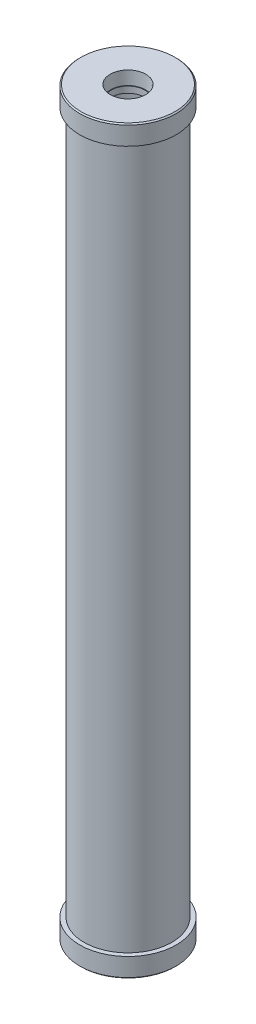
ISO-10303-21;
HEADER;
FILE_DESCRIPTION(('STEP AP214'),'2;1');
FILE_NAME('part.step','',(''),(''),'','','');
FILE_SCHEMA(('AUTOMOTIVE_DESIGN { 1 0 10303 214 1 1 1 1 }'));
ENDSEC;
DATA;
#1=APPLICATION_CONTEXT('core data for automotive mechanical design processes');
#2=APPLICATION_PROTOCOL_DEFINITION('international standard','automotive_design',2000,#1);
#3=PRODUCT_CONTEXT('',#1,'mechanical');
#4=PRODUCT('Part','Part','',(#3));
#5=PRODUCT_RELATED_PRODUCT_CATEGORY('part','',(#4));
#6=PRODUCT_DEFINITION_FORMATION('','',#4);
#7=PRODUCT_DEFINITION_CONTEXT('part definition',#1,'design');
#8=PRODUCT_DEFINITION('design','',#6,#7);
#9=PRODUCT_DEFINITION_SHAPE('','',#8);
#10=(LENGTH_UNIT() NAMED_UNIT(*) SI_UNIT(.MILLI.,.METRE.));
#11=(NAMED_UNIT(*) PLANE_ANGLE_UNIT() SI_UNIT($,.RADIAN.));
#12=(NAMED_UNIT(*) SI_UNIT($,.STERADIAN.) SOLID_ANGLE_UNIT());
#13=UNCERTAINTY_MEASURE_WITH_UNIT(LENGTH_MEASURE(1.E-05),#10,'distance_accuracy_value','');
#14=(GEOMETRIC_REPRESENTATION_CONTEXT(3) GLOBAL_UNCERTAINTY_ASSIGNED_CONTEXT((#13)) GLOBAL_UNIT_ASSIGNED_CONTEXT((#10,
#11,#12)) REPRESENTATION_CONTEXT('',''));
#15=CARTESIAN_POINT('',(0.,0.,0.));
#16=DIRECTION('',(0.,0.,1.));
#17=DIRECTION('',(1.,0.,0.));
#18=AXIS2_PLACEMENT_3D('',#15,#16,#17);
#19=CARTESIAN_POINT('',(0.,965.2,0.));
#20=DIRECTION('',(0.,-1.,0.));
#21=DIRECTION('',(0.,0.,-1.));
#22=AXIS2_PLACEMENT_3D('',#19,#20,#21);
#23=CYLINDRICAL_SURFACE('',#22,57.15);
#24=CARTESIAN_POINT('',(0.,25.4,0.));
#25=DIRECTION('',(0.,1.,0.));
#26=DIRECTION('',(0.,0.,1.));
#27=AXIS2_PLACEMENT_3D('',#24,#25,#26);
#28=CIRCLE('',#27,57.15);
#29=CARTESIAN_POINT('',(0.,25.3999999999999,-57.15));
#30=VERTEX_POINT('',#29);
#31=EDGE_CURVE('E71',#30,#30,#28,.T.);
#32=CARTESIAN_POINT('',(0.,939.8,0.));
#33=DIRECTION('',(0.,1.,0.));
#34=DIRECTION('',(0.,0.,1.));
#35=AXIS2_PLACEMENT_3D('',#32,#33,#34);
#36=CIRCLE('',#35,57.15);
#37=CARTESIAN_POINT('',(0.,939.8,-57.15));
#38=VERTEX_POINT('',#37);
#39=EDGE_CURVE('E53',#38,#38,#36,.T.);
#40=CARTESIAN_POINT('',(0.,25.3999999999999,-57.15));
#41=CARTESIAN_POINT('',(0.,34.9249999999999,-57.15));
#42=CARTESIAN_POINT('',(0.,44.4499999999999,-57.15));
#43=CARTESIAN_POINT('',(0.,63.4999999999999,-57.15));
#44=CARTESIAN_POINT('',(0.,73.0249999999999,-57.15));
#45=CARTESIAN_POINT('',(0.,92.0749999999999,-57.15));
#46=CARTESIAN_POINT('',(0.,101.6,-57.15));
#47=CARTESIAN_POINT('',(0.,120.65,-57.15));
#48=CARTESIAN_POINT('',(0.,130.175,-57.15));
#49=CARTESIAN_POINT('',(0.,149.225,-57.15));
#50=CARTESIAN_POINT('',(0.,158.75,-57.15));
#51=CARTESIAN_POINT('',(0.,177.8,-57.15));
#52=CARTESIAN_POINT('',(0.,187.325,-57.15));
#53=CARTESIAN_POINT('',(0.,206.375,-57.15));
#54=CARTESIAN_POINT('',(0.,215.9,-57.15));
#55=CARTESIAN_POINT('',(0.,234.95,-57.15));
#56=CARTESIAN_POINT('',(0.,244.475,-57.15));
#57=CARTESIAN_POINT('',(0.,263.525,-57.15));
#58=CARTESIAN_POINT('',(0.,273.05,-57.15));
#59=CARTESIAN_POINT('',(0.,292.1,-57.15));
#60=CARTESIAN_POINT('',(0.,301.625,-57.15));
#61=CARTESIAN_POINT('',(0.,320.675,-57.15));
#62=CARTESIAN_POINT('',(0.,330.2,-57.15));
#63=CARTESIAN_POINT('',(0.,349.25,-57.15));
#64=CARTESIAN_POINT('',(0.,358.775,-57.15));
#65=CARTESIAN_POINT('',(0.,377.825,-57.15));
#66=CARTESIAN_POINT('',(0.,387.35,-57.15));
#67=CARTESIAN_POINT('',(0.,406.4,-57.15));
#68=CARTESIAN_POINT('',(0.,415.925,-57.15));
#69=CARTESIAN_POINT('',(0.,434.975,-57.15));
#70=CARTESIAN_POINT('',(0.,444.5,-57.15));
#71=CARTESIAN_POINT('',(0.,463.55,-57.15));
#72=CARTESIAN_POINT('',(0.,473.075,-57.15));
#73=CARTESIAN_POINT('',(0.,492.125,-57.15));
#74=CARTESIAN_POINT('',(0.,501.65,-57.15));
#75=CARTESIAN_POINT('',(0.,520.7,-57.15));
#76=CARTESIAN_POINT('',(0.,530.225,-57.15));
#77=CARTESIAN_POINT('',(0.,549.275,-57.15));
#78=CARTESIAN_POINT('',(0.,558.8,-57.15));
#79=CARTESIAN_POINT('',(0.,577.85,-57.15));
#80=CARTESIAN_POINT('',(0.,587.375,-57.15));
#81=CARTESIAN_POINT('',(0.,606.425,-57.15));
#82=CARTESIAN_POINT('',(0.,615.95,-57.15));
#83=CARTESIAN_POINT('',(0.,635.,-57.15));
#84=CARTESIAN_POINT('',(0.,644.525,-57.15));
#85=CARTESIAN_POINT('',(0.,663.575,-57.15));
#86=CARTESIAN_POINT('',(0.,673.1,-57.15));
#87=CARTESIAN_POINT('',(0.,692.15,-57.15));
#88=CARTESIAN_POINT('',(0.,701.675,-57.15));
#89=CARTESIAN_POINT('',(0.,720.725,-57.15));
#90=CARTESIAN_POINT('',(0.,730.25,-57.15));
#91=CARTESIAN_POINT('',(0.,749.3,-57.15));
#92=CARTESIAN_POINT('',(0.,758.825,-57.15));
#93=CARTESIAN_POINT('',(0.,777.875,-57.15));
#94=CARTESIAN_POINT('',(0.,787.4,-57.15));
#95=CARTESIAN_POINT('',(0.,806.45,-57.15));
#96=CARTESIAN_POINT('',(0.,815.975,-57.15));
#97=CARTESIAN_POINT('',(0.,835.025,-57.15));
#98=CARTESIAN_POINT('',(0.,844.55,-57.15));
#99=CARTESIAN_POINT('',(0.,863.6,-57.15));
#100=CARTESIAN_POINT('',(0.,873.125,-57.15));
#101=CARTESIAN_POINT('',(0.,892.175,-57.15));
#102=CARTESIAN_POINT('',(0.,901.7,-57.15));
#103=CARTESIAN_POINT('',(0.,920.75,-57.15));
#104=CARTESIAN_POINT('',(0.,930.275,-57.15));
#105=CARTESIAN_POINT('',(0.,939.8,-57.15));
#106=B_SPLINE_CURVE_WITH_KNOTS('',3,(#40,#41,#42,#43,#44,#45,#46,#47,#48,#49,#50,#51,#52,#53,
#54,#55,#56,#57,#58,#59,#60,#61,#62,#63,#64,#65,#66,#67,#68,#69,#70,#71,#72,#73,#74,#75,#76,#77,
#78,#79,#80,#81,#82,#83,#84,#85,#86,#87,#88,#89,#90,#91,#92,#93,#94,#95,#96,#97,#98,#99,#100,
#101,#102,#103,#104,#105),.UNSPECIFIED.,.F.,.F.,(4,2,2,2,2,2,2,2,2,2,2,2,2,2,2,2,2,2,2,2,2,2,2,
2,2,2,2,2,2,2,2,2,4),(0.,28.575,57.15,85.7250000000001,114.3,142.875,171.45,200.025,228.6,
257.175,285.75,314.325,342.9,371.475,400.05,428.625,457.2,485.775,514.35,542.925,571.5,600.075,
628.65,657.225,685.8,714.375,742.95,771.525,800.1,828.675,857.25,885.825,914.4),.UNSPECIFIED.);
#107=EDGE_CURVE('BSEAM33',#30,#38,#106,.T.);
#108=ORIENTED_EDGE('',*,*,#31,.T.);
#109=ORIENTED_EDGE('',*,*,#39,.F.);
#110=ORIENTED_EDGE('',*,*,#107,.T.);
#111=ORIENTED_EDGE('',*,*,#107,.F.);
#112=EDGE_LOOP('',(#108,#110,#109,#111));
#113=FACE_BOUND('',#112,.T.);
#114=ADVANCED_FACE('F33',(#113),#23,.T.);
#115=CARTESIAN_POINT('',(0.,965.2,0.));
#116=DIRECTION('',(0.,-1.,0.));
#117=DIRECTION('',(0.,0.,-1.));
#118=AXIS2_PLACEMENT_3D('',#115,#116,#117);
#119=CYLINDRICAL_SURFACE('',#118,50.546);
#120=CARTESIAN_POINT('',(0.,25.4,0.));
#121=DIRECTION('',(0.,1.,0.));
#122=DIRECTION('',(0.,0.,1.));
#123=AXIS2_PLACEMENT_3D('',#120,#121,#122);
#124=CIRCLE('',#123,50.546);
#125=CARTESIAN_POINT('',(0.,25.3999999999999,-50.546));
#126=VERTEX_POINT('',#125);
#127=EDGE_CURVE('E68',#126,#126,#124,.T.);
#128=CARTESIAN_POINT('',(0.,939.8,0.));
#129=DIRECTION('',(0.,1.,0.));
#130=DIRECTION('',(0.,0.,1.));
#131=AXIS2_PLACEMENT_3D('',#128,#129,#130);
#132=CIRCLE('',#131,50.546);
#133=CARTESIAN_POINT('',(0.,939.8,-50.546));
#134=VERTEX_POINT('',#133);
#135=EDGE_CURVE('E59',#134,#134,#132,.T.);
#136=CARTESIAN_POINT('',(0.,25.3999999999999,-50.546));
#137=CARTESIAN_POINT('',(0.,34.9249999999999,-50.546));
#138=CARTESIAN_POINT('',(0.,44.4499999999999,-50.546));
#139=CARTESIAN_POINT('',(0.,63.4999999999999,-50.546));
#140=CARTESIAN_POINT('',(0.,73.0249999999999,-50.546));
#141=CARTESIAN_POINT('',(0.,92.0749999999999,-50.546));
#142=CARTESIAN_POINT('',(0.,101.6,-50.546));
#143=CARTESIAN_POINT('',(0.,120.65,-50.546));
#144=CARTESIAN_POINT('',(0.,130.175,-50.546));
#145=CARTESIAN_POINT('',(0.,149.225,-50.546));
#146=CARTESIAN_POINT('',(0.,158.75,-50.546));
#147=CARTESIAN_POINT('',(0.,177.8,-50.546));
#148=CARTESIAN_POINT('',(0.,187.325,-50.546));
#149=CARTESIAN_POINT('',(0.,206.375,-50.546));
#150=CARTESIAN_POINT('',(0.,215.9,-50.546));
#151=CARTESIAN_POINT('',(0.,234.95,-50.546));
#152=CARTESIAN_POINT('',(0.,244.475,-50.546));
#153=CARTESIAN_POINT('',(0.,263.525,-50.546));
#154=CARTESIAN_POINT('',(0.,273.05,-50.546));
#155=CARTESIAN_POINT('',(0.,292.1,-50.546));
#156=CARTESIAN_POINT('',(0.,301.625,-50.546));
#157=CARTESIAN_POINT('',(0.,320.675,-50.546));
#158=CARTESIAN_POINT('',(0.,330.2,-50.546));
#159=CARTESIAN_POINT('',(0.,349.25,-50.546));
#160=CARTESIAN_POINT('',(0.,358.775,-50.546));
#161=CARTESIAN_POINT('',(0.,377.825,-50.546));
#162=CARTESIAN_POINT('',(0.,387.35,-50.546));
#163=CARTESIAN_POINT('',(0.,406.4,-50.546));
#164=CARTESIAN_POINT('',(0.,415.925,-50.546));
#165=CARTESIAN_POINT('',(0.,434.975,-50.546));
#166=CARTESIAN_POINT('',(0.,444.5,-50.546));
#167=CARTESIAN_POINT('',(0.,463.55,-50.546));
#168=CARTESIAN_POINT('',(0.,473.075,-50.546));
#169=CARTESIAN_POINT('',(0.,492.125,-50.546));
#170=CARTESIAN_POINT('',(0.,501.65,-50.546));
#171=CARTESIAN_POINT('',(0.,520.7,-50.546));
#172=CARTESIAN_POINT('',(0.,530.225,-50.546));
#173=CARTESIAN_POINT('',(0.,549.275,-50.546));
#174=CARTESIAN_POINT('',(0.,558.8,-50.546));
#175=CARTESIAN_POINT('',(0.,577.85,-50.546));
#176=CARTESIAN_POINT('',(0.,587.375,-50.546));
#177=CARTESIAN_POINT('',(0.,606.425,-50.546));
#178=CARTESIAN_POINT('',(0.,615.95,-50.546));
#179=CARTESIAN_POINT('',(0.,635.,-50.546));
#180=CARTESIAN_POINT('',(0.,644.525,-50.546));
#181=CARTESIAN_POINT('',(0.,663.575,-50.546));
#182=CARTESIAN_POINT('',(0.,673.1,-50.546));
#183=CARTESIAN_POINT('',(0.,692.15,-50.546));
#184=CARTESIAN_POINT('',(0.,701.675,-50.546));
#185=CARTESIAN_POINT('',(0.,720.725,-50.546));
#186=CARTESIAN_POINT('',(0.,730.25,-50.546));
#187=CARTESIAN_POINT('',(0.,749.3,-50.546));
#188=CARTESIAN_POINT('',(0.,758.825,-50.546));
#189=CARTESIAN_POINT('',(0.,777.875,-50.546));
#190=CARTESIAN_POINT('',(0.,787.4,-50.546));
#191=CARTESIAN_POINT('',(0.,806.45,-50.546));
#192=CARTESIAN_POINT('',(0.,815.975,-50.546));
#193=CARTESIAN_POINT('',(0.,835.025,-50.546));
#194=CARTESIAN_POINT('',(0.,844.55,-50.546));
#195=CARTESIAN_POINT('',(0.,863.6,-50.546));
#196=CARTESIAN_POINT('',(0.,873.125,-50.546));
#197=CARTESIAN_POINT('',(0.,892.175,-50.546));
#198=CARTESIAN_POINT('',(0.,901.7,-50.546));
#199=CARTESIAN_POINT('',(0.,920.75,-50.546));
#200=CARTESIAN_POINT('',(0.,930.275,-50.546));
#201=CARTESIAN_POINT('',(0.,939.8,-50.546));
#202=B_SPLINE_CURVE_WITH_KNOTS('',3,(#136,#137,#138,#139,#140,#141,#142,#143,#144,#145,#146,
#147,#148,#149,#150,#151,#152,#153,#154,#155,#156,#157,#158,#159,#160,#161,#162,#163,#164,#165,
#166,#167,#168,#169,#170,#171,#172,#173,#174,#175,#176,#177,#178,#179,#180,#181,#182,#183,#184,
#185,#186,#187,#188,#189,#190,#191,#192,#193,#194,#195,#196,#197,#198,#199,#200,#201),
.UNSPECIFIED.,.F.,.F.,(4,2,2,2,2,2,2,2,2,2,2,2,2,2,2,2,2,2,2,2,2,2,2,2,2,2,2,2,2,2,2,2,4),(0.,
28.575,57.15,85.7250000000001,114.3,142.875,171.45,200.025,228.6,257.175,285.75,314.325,342.9,
371.475,400.05,428.625,457.2,485.775,514.35,542.925,571.5,600.075,628.65,657.225,685.8,714.375,
742.95,771.525,800.1,828.675,857.25,885.825,914.4),.UNSPECIFIED.);
#203=EDGE_CURVE('BSEAM115',#126,#134,#202,.T.);
#204=ORIENTED_EDGE('',*,*,#127,.F.);
#205=ORIENTED_EDGE('',*,*,#135,.T.);
#206=ORIENTED_EDGE('',*,*,#203,.T.);
#207=ORIENTED_EDGE('',*,*,#203,.F.);
#208=EDGE_LOOP('',(#204,#206,#205,#207));
#209=FACE_BOUND('',#208,.T.);
#210=ADVANCED_FACE('F115',(#209),#119,.F.);
#211=CARTESIAN_POINT('',(0.,25.4,0.));
#212=DIRECTION('',(0.,1.,0.));
#213=DIRECTION('',(0.,0.,1.));
#214=AXIS2_PLACEMENT_3D('',#211,#212,#213);
#215=PLANE('',#214);
#216=CARTESIAN_POINT('',(0.,25.4,0.));
#217=DIRECTION('',(0.,1.,0.));
#218=DIRECTION('',(0.,0.,1.));
#219=AXIS2_PLACEMENT_3D('',#216,#217,#218);
#220=CIRCLE('',#219,21.8313);
#221=CARTESIAN_POINT('',(0.,25.4,21.8313));
#222=VERTEX_POINT('',#221);
#223=EDGE_CURVE('E63',#222,#222,#220,.T.);
#224=ORIENTED_EDGE('',*,*,#223,.F.);
#225=EDGE_LOOP('',(#224));
#226=FACE_BOUND('',#225,.T.);
#227=ORIENTED_EDGE('',*,*,#127,.T.);
#228=EDGE_LOOP('',(#227));
#229=FACE_BOUND('',#228,.T.);
#230=ADVANCED_FACE('F121',(#226,#229),#215,.T.);
#231=CARTESIAN_POINT('',(0.,25.4,0.));
#232=DIRECTION('',(0.,1.,0.));
#233=DIRECTION('',(0.,0.,1.));
#234=AXIS2_PLACEMENT_3D('',#231,#232,#233);
#235=CIRCLE('',#234,62.865);
#236=CARTESIAN_POINT('',(0.,25.4,62.865));
#237=VERTEX_POINT('',#236);
#238=EDGE_CURVE('E66',#237,#237,#235,.T.);
#239=ORIENTED_EDGE('',*,*,#238,.T.);
#240=EDGE_LOOP('',(#239));
#241=FACE_BOUND('',#240,.T.);
#242=ORIENTED_EDGE('',*,*,#31,.F.);
#243=EDGE_LOOP('',(#242));
#244=FACE_BOUND('',#243,.T.);
#245=ADVANCED_FACE('F142',(#241,#244),#215,.T.);
#246=CARTESIAN_POINT('',(0.,25.4,0.));
#247=DIRECTION('',(0.,-1.,0.));
#248=DIRECTION('',(0.,0.,-1.));
#249=AXIS2_PLACEMENT_3D('',#246,#247,#248);
#250=CYLINDRICAL_SURFACE('',#249,62.865);
#251=CARTESIAN_POINT('',(0.,1.52400000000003,0.));
#252=DIRECTION('',(0.,1.,0.));
#253=DIRECTION('',(0.,0.,1.));
#254=AXIS2_PLACEMENT_3D('',#251,#252,#253);
#255=CIRCLE('',#254,62.865);
#256=CARTESIAN_POINT('',(0.,1.52400000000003,62.865));
#257=VERTEX_POINT('',#256);
#258=EDGE_CURVE('E48',#257,#257,#255,.T.);
#259=ORIENTED_EDGE('',*,*,#258,.T.);
#260=EDGE_LOOP('',(#259));
#261=FACE_BOUND('',#260,.T.);
#262=ORIENTED_EDGE('',*,*,#238,.F.);
#263=EDGE_LOOP('',(#262));
#264=FACE_BOUND('',#263,.T.);
#265=ADVANCED_FACE('F139',(#261,#264),#250,.T.);
#266=CARTESIAN_POINT('',(0.,0.,0.));
#267=DIRECTION('',(0.,1.,0.));
#268=DIRECTION('',(0.,0.,1.));
#269=AXIS2_PLACEMENT_3D('',#266,#267,#268);
#270=PLANE('',#269);
#271=CARTESIAN_POINT('',(0.,0.,0.));
#272=DIRECTION('',(0.,1.,0.));
#273=DIRECTION('',(0.,0.,1.));
#274=AXIS2_PLACEMENT_3D('',#271,#272,#273);
#275=CIRCLE('',#274,61.341);
#276=CARTESIAN_POINT('',(0.,0.,61.341));
#277=VERTEX_POINT('',#276);
#278=EDGE_CURVE('E44',#277,#277,#275,.F.);
#279=ORIENTED_EDGE('',*,*,#278,.T.);
#280=EDGE_LOOP('',(#279));
#281=FACE_BOUND('',#280,.T.);
#282=CARTESIAN_POINT('',(0.,0.,0.));
#283=DIRECTION('',(0.,-1.,0.));
#284=DIRECTION('',(0.,0.,-1.));
#285=AXIS2_PLACEMENT_3D('',#282,#283,#284);
#286=CIRCLE('',#285,23.1430322);
#287=CARTESIAN_POINT('',(0.,0.,-23.1430322));
#288=VERTEX_POINT('',#287);
#289=EDGE_CURVE('E62',#288,#288,#286,.T.);
#290=ORIENTED_EDGE('',*,*,#289,.F.);
#291=EDGE_LOOP('',(#290));
#292=FACE_BOUND('',#291,.T.);
#293=ADVANCED_FACE('F124',(#281,#292),#270,.F.);
#294=CARTESIAN_POINT('',(0.,0.,0.));
#295=DIRECTION('',(0.,-1.,0.));
#296=DIRECTION('',(0.,0.,-1.));
#297=AXIS2_PLACEMENT_3D('',#294,#295,#296);
#298=CYLINDRICAL_SURFACE('',#297,21.8313);
#299=ORIENTED_EDGE('',*,*,#223,.T.);
#300=EDGE_LOOP('',(#299));
#301=FACE_BOUND('',#300,.T.);
#302=CARTESIAN_POINT('',(0.,17.272,0.));
#303=DIRECTION('',(0.,-1.,0.));
#304=DIRECTION('',(0.,0.,-1.));
#305=AXIS2_PLACEMENT_3D('',#302,#303,#304);
#306=CIRCLE('',#305,21.8313);
#307=CARTESIAN_POINT('',(0.,17.272,-21.8313));
#308=VERTEX_POINT('',#307);
#309=EDGE_CURVE('E67',#308,#308,#306,.T.);
#310=ORIENTED_EDGE('',*,*,#309,.T.);
#311=EDGE_LOOP('',(#310));
#312=FACE_BOUND('',#311,.T.);
#313=ADVANCED_FACE('F155',(#301,#312),#298,.F.);
#314=CARTESIAN_POINT('',(21.8313,17.272,0.));
#315=DIRECTION('',(0.,1.,0.));
#316=DIRECTION('',(0.,0.,1.));
#317=AXIS2_PLACEMENT_3D('',#314,#315,#316);
#318=PLANE('',#317);
#319=ORIENTED_EDGE('',*,*,#309,.F.);
#320=EDGE_LOOP('',(#319));
#321=FACE_BOUND('',#320,.T.);
#322=CARTESIAN_POINT('',(0.,17.272,0.));
#323=DIRECTION('',(0.,-1.,0.));
#324=DIRECTION('',(0.,0.,-1.));
#325=AXIS2_PLACEMENT_3D('',#322,#323,#324);
#326=CIRCLE('',#325,22.6258853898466);
#327=CARTESIAN_POINT('',(0.,17.272,-22.6258853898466));
#328=VERTEX_POINT('',#327);
#329=EDGE_CURVE('E78',#328,#328,#326,.T.);
#330=ORIENTED_EDGE('',*,*,#329,.T.);
#331=EDGE_LOOP('',(#330));
#332=FACE_BOUND('',#331,.T.);
#333=ADVANCED_FACE('F158',(#321,#332),#318,.F.);
#334=CARTESIAN_POINT('',(0.,0.,0.));
#335=DIRECTION('',(0.,-1.,0.));
#336=DIRECTION('',(0.,0.,-1.));
#337=AXIS2_PLACEMENT_3D('',#334,#335,#336);
#338=CONICAL_SURFACE('',#337,23.1430322,0.0299323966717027);
#339=ORIENTED_EDGE('',*,*,#329,.F.);
#340=EDGE_LOOP('',(#339));
#341=FACE_BOUND('',#340,.T.);
#342=ORIENTED_EDGE('',*,*,#289,.T.);
#343=EDGE_LOOP('',(#342));
#344=FACE_BOUND('',#343,.T.);
#345=ADVANCED_FACE('F162',(#341,#344),#338,.F.);
#346=CARTESIAN_POINT('',(0.,939.8,0.));
#347=DIRECTION('',(0.,1.,0.));
#348=DIRECTION('',(0.,0.,1.));
#349=AXIS2_PLACEMENT_3D('',#346,#347,#348);
#350=PLANE('',#349);
#351=CARTESIAN_POINT('',(0.,939.8,0.));
#352=DIRECTION('',(0.,1.,0.));
#353=DIRECTION('',(0.,0.,1.));
#354=AXIS2_PLACEMENT_3D('',#351,#352,#353);
#355=CIRCLE('',#354,21.8313);
#356=CARTESIAN_POINT('',(0.,939.8,21.8313));
#357=VERTEX_POINT('',#356);
#358=EDGE_CURVE('E54',#357,#357,#355,.T.);
#359=ORIENTED_EDGE('',*,*,#358,.T.);
#360=EDGE_LOOP('',(#359));
#361=FACE_BOUND('',#360,.T.);
#362=ORIENTED_EDGE('',*,*,#135,.F.);
#363=EDGE_LOOP('',(#362));
#364=FACE_BOUND('',#363,.T.);
#365=ADVANCED_FACE('F165',(#361,#364),#350,.F.);
#366=CARTESIAN_POINT('',(0.,939.8,0.));
#367=DIRECTION('',(0.,1.,0.));
#368=DIRECTION('',(0.,0.,1.));
#369=AXIS2_PLACEMENT_3D('',#366,#367,#368);
#370=CIRCLE('',#369,62.865);
#371=CARTESIAN_POINT('',(0.,939.8,62.865));
#372=VERTEX_POINT('',#371);
#373=EDGE_CURVE('E57',#372,#372,#370,.T.);
#374=ORIENTED_EDGE('',*,*,#373,.F.);
#375=EDGE_LOOP('',(#374));
#376=FACE_BOUND('',#375,.T.);
#377=ORIENTED_EDGE('',*,*,#39,.T.);
#378=EDGE_LOOP('',(#377));
#379=FACE_BOUND('',#378,.T.);
#380=ADVANCED_FACE('F110',(#376,#379),#350,.F.);
#381=CARTESIAN_POINT('',(0.,939.8,0.));
#382=DIRECTION('',(0.,1.,0.));
#383=DIRECTION('',(0.,0.,1.));
#384=AXIS2_PLACEMENT_3D('',#381,#382,#383);
#385=CYLINDRICAL_SURFACE('',#384,62.865);
#386=CARTESIAN_POINT('',(0.,963.676,0.));
#387=DIRECTION('',(0.,1.,0.));
#388=DIRECTION('',(0.,0.,1.));
#389=AXIS2_PLACEMENT_3D('',#386,#387,#388);
#390=CIRCLE('',#389,62.865);
#391=CARTESIAN_POINT('',(0.,963.676,62.865));
#392=VERTEX_POINT('',#391);
#393=EDGE_CURVE('E10',#392,#392,#390,.F.);
#394=ORIENTED_EDGE('',*,*,#393,.T.);
#395=EDGE_LOOP('',(#394));
#396=FACE_BOUND('',#395,.T.);
#397=ORIENTED_EDGE('',*,*,#373,.T.);
#398=EDGE_LOOP('',(#397));
#399=FACE_BOUND('',#398,.T.);
#400=ADVANCED_FACE('F101',(#396,#399),#385,.T.);
#401=CARTESIAN_POINT('',(0.,965.2,0.));
#402=DIRECTION('',(0.,1.,0.));
#403=DIRECTION('',(0.,0.,1.));
#404=AXIS2_PLACEMENT_3D('',#401,#402,#403);
#405=PLANE('',#404);
#406=CARTESIAN_POINT('',(0.,965.2,0.));
#407=DIRECTION('',(0.,1.,0.));
#408=DIRECTION('',(0.,0.,1.));
#409=AXIS2_PLACEMENT_3D('',#406,#407,#408);
#410=CIRCLE('',#409,61.3410000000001);
#411=CARTESIAN_POINT('',(0.,965.2,61.3410000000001));
#412=VERTEX_POINT('',#411);
#413=EDGE_CURVE('E40',#412,#412,#410,.T.);
#414=ORIENTED_EDGE('',*,*,#413,.T.);
#415=EDGE_LOOP('',(#414));
#416=FACE_BOUND('',#415,.T.);
#417=CARTESIAN_POINT('',(0.,965.2,0.));
#418=DIRECTION('',(0.,1.,0.));
#419=DIRECTION('',(0.,0.,1.));
#420=AXIS2_PLACEMENT_3D('',#417,#418,#419);
#421=CIRCLE('',#420,23.1430322);
#422=CARTESIAN_POINT('',(0.,965.2,23.1430322));
#423=VERTEX_POINT('',#422);
#424=EDGE_CURVE('E92',#423,#423,#421,.T.);
#425=ORIENTED_EDGE('',*,*,#424,.F.);
#426=EDGE_LOOP('',(#425));
#427=FACE_BOUND('',#426,.T.);
#428=ADVANCED_FACE('F98',(#416,#427),#405,.T.);
#429=CARTESIAN_POINT('',(0.,965.2,0.));
#430=DIRECTION('',(0.,1.,0.));
#431=DIRECTION('',(0.,0.,1.));
#432=AXIS2_PLACEMENT_3D('',#429,#430,#431);
#433=CYLINDRICAL_SURFACE('',#432,21.8313);
#434=CARTESIAN_POINT('',(0.,947.928,0.));
#435=DIRECTION('',(0.,1.,0.));
#436=DIRECTION('',(0.,0.,1.));
#437=AXIS2_PLACEMENT_3D('',#434,#435,#436);
#438=CIRCLE('',#437,21.8313);
#439=CARTESIAN_POINT('',(0.,947.928,21.8313));
#440=VERTEX_POINT('',#439);
#441=EDGE_CURVE('E58',#440,#440,#438,.T.);
#442=ORIENTED_EDGE('',*,*,#441,.T.);
#443=EDGE_LOOP('',(#442));
#444=FACE_BOUND('',#443,.T.);
#445=ORIENTED_EDGE('',*,*,#358,.F.);
#446=EDGE_LOOP('',(#445));
#447=FACE_BOUND('',#446,.T.);
#448=ADVANCED_FACE('F100',(#444,#447),#433,.F.);
#449=CARTESIAN_POINT('',(21.8313,947.928,0.));
#450=DIRECTION('',(0.,-1.,0.));
#451=DIRECTION('',(0.,0.,-1.));
#452=AXIS2_PLACEMENT_3D('',#449,#450,#451);
#453=PLANE('',#452);
#454=ORIENTED_EDGE('',*,*,#441,.F.);
#455=EDGE_LOOP('',(#454));
#456=FACE_BOUND('',#455,.T.);
#457=CARTESIAN_POINT('',(0.,947.928,0.));
#458=DIRECTION('',(0.,1.,0.));
#459=DIRECTION('',(0.,0.,1.));
#460=AXIS2_PLACEMENT_3D('',#457,#458,#459);
#461=CIRCLE('',#460,22.6258853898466);
#462=CARTESIAN_POINT('',(0.,947.928,22.6258853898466));
#463=VERTEX_POINT('',#462);
#464=EDGE_CURVE('E89',#463,#463,#461,.T.);
#465=ORIENTED_EDGE('',*,*,#464,.T.);
#466=EDGE_LOOP('',(#465));
#467=FACE_BOUND('',#466,.T.);
#468=ADVANCED_FACE('F107',(#456,#467),#453,.F.);
#469=CARTESIAN_POINT('',(0.,965.2,0.));
#470=DIRECTION('',(0.,1.,0.));
#471=DIRECTION('',(0.,0.,1.));
#472=AXIS2_PLACEMENT_3D('',#469,#470,#471);
#473=CONICAL_SURFACE('',#472,23.1430322,0.0299323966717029);
#474=ORIENTED_EDGE('',*,*,#464,.F.);
#475=EDGE_LOOP('',(#474));
#476=FACE_BOUND('',#475,.T.);
#477=ORIENTED_EDGE('',*,*,#424,.T.);
#478=EDGE_LOOP('',(#477));
#479=FACE_BOUND('',#478,.T.);
#480=ADVANCED_FACE('F96',(#476,#479),#473,.F.);
#481=CARTESIAN_POINT('',(0.,1.52400000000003,0.));
#482=DIRECTION('',(0.,1.,0.));
#483=DIRECTION('',(0.,0.,1.));
#484=AXIS2_PLACEMENT_3D('',#481,#482,#483);
#485=CONICAL_SURFACE('',#484,62.865,0.785398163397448);
#486=CARTESIAN_POINT('',(0.,0.,61.341));
#487=CARTESIAN_POINT('',(0.,0.0158749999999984,61.356875));
#488=CARTESIAN_POINT('',(0.,0.0317499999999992,61.37275));
#489=CARTESIAN_POINT('',(0.,0.0635000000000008,61.4045));
#490=CARTESIAN_POINT('',(0.,0.0793750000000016,61.420375));
#491=CARTESIAN_POINT('',(0.,0.111125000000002,61.452125));
#492=CARTESIAN_POINT('',(0.,0.127000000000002,61.468));
#493=CARTESIAN_POINT('',(0.,0.158750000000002,61.49975));
#494=CARTESIAN_POINT('',(0.,0.174625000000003,61.515625));
#495=CARTESIAN_POINT('',(0.,0.206375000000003,61.547375));
#496=CARTESIAN_POINT('',(0.,0.222250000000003,61.56325));
#497=CARTESIAN_POINT('',(0.,0.254000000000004,61.595));
#498=CARTESIAN_POINT('',(0.,0.269875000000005,61.610875));
#499=CARTESIAN_POINT('',(0.,0.301625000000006,61.642625));
#500=CARTESIAN_POINT('',(0.,0.317500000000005,61.6585));
#501=CARTESIAN_POINT('',(0.,0.349250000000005,61.69025));
#502=CARTESIAN_POINT('',(0.,0.365125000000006,61.706125));
#503=CARTESIAN_POINT('',(0.,0.396875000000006,61.737875));
#504=CARTESIAN_POINT('',(0.,0.412750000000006,61.75375));
#505=CARTESIAN_POINT('',(0.,0.444500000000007,61.7855));
#506=CARTESIAN_POINT('',(0.,0.460375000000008,61.801375));
#507=CARTESIAN_POINT('',(0.,0.492125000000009,61.833125));
#508=CARTESIAN_POINT('',(0.,0.508000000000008,61.849));
#509=CARTESIAN_POINT('',(0.,0.539750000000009,61.88075));
#510=CARTESIAN_POINT('',(0.,0.555625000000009,61.896625));
#511=CARTESIAN_POINT('',(0.,0.587375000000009,61.928375));
#512=CARTESIAN_POINT('',(0.,0.603250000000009,61.94425));
#513=CARTESIAN_POINT('',(0.,0.63500000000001,61.976));
#514=CARTESIAN_POINT('',(0.,0.650875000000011,61.991875));
#515=CARTESIAN_POINT('',(0.,0.682625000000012,62.023625));
#516=CARTESIAN_POINT('',(0.,0.698500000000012,62.0395));
#517=CARTESIAN_POINT('',(0.,0.730250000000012,62.07125));
#518=CARTESIAN_POINT('',(0.,0.746125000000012,62.087125));
#519=CARTESIAN_POINT('',(0.,0.777875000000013,62.118875));
#520=CARTESIAN_POINT('',(0.,0.793750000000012,62.13475));
#521=CARTESIAN_POINT('',(0.,0.825500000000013,62.1665));
#522=CARTESIAN_POINT('',(0.,0.841375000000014,62.182375));
#523=CARTESIAN_POINT('',(0.,0.873125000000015,62.214125));
#524=CARTESIAN_POINT('',(0.,0.889000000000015,62.23));
#525=CARTESIAN_POINT('',(0.,0.920750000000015,62.26175));
#526=CARTESIAN_POINT('',(0.,0.936625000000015,62.277625));
#527=CARTESIAN_POINT('',(0.,0.968375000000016,62.309375));
#528=CARTESIAN_POINT('',(0.,0.984250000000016,62.32525));
#529=CARTESIAN_POINT('',(0.,1.01600000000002,62.357));
#530=CARTESIAN_POINT('',(0.,1.03187500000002,62.372875));
#531=CARTESIAN_POINT('',(0.,1.06362500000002,62.404625));
#532=CARTESIAN_POINT('',(0.,1.07950000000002,62.4205));
#533=CARTESIAN_POINT('',(0.,1.11125000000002,62.45225));
#534=CARTESIAN_POINT('',(0.,1.12712500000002,62.468125));
#535=CARTESIAN_POINT('',(0.,1.15887500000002,62.499875));
#536=CARTESIAN_POINT('',(0.,1.17475000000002,62.51575));
#537=CARTESIAN_POINT('',(0.,1.20650000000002,62.5475));
#538=CARTESIAN_POINT('',(0.,1.22237500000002,62.563375));
#539=CARTESIAN_POINT('',(0.,1.25412500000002,62.595125));
#540=CARTESIAN_POINT('',(0.,1.27000000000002,62.611));
#541=CARTESIAN_POINT('',(0.,1.30175000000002,62.64275));
#542=CARTESIAN_POINT('',(0.,1.31762500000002,62.658625));
#543=CARTESIAN_POINT('',(0.,1.34937500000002,62.690375));
#544=CARTESIAN_POINT('',(0.,1.36525000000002,62.70625));
#545=CARTESIAN_POINT('',(0.,1.39700000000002,62.738));
#546=CARTESIAN_POINT('',(0.,1.41287500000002,62.753875));
#547=CARTESIAN_POINT('',(0.,1.44462500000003,62.785625));
#548=CARTESIAN_POINT('',(0.,1.46050000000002,62.8015));
#549=CARTESIAN_POINT('',(0.,1.49225000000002,62.83325));
#550=CARTESIAN_POINT('',(0.,1.50812500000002,62.849125));
#551=CARTESIAN_POINT('',(0.,1.52400000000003,62.865));
#552=B_SPLINE_CURVE_WITH_KNOTS('',3,(#486,#487,#488,#489,#490,#491,#492,#493,#494,#495,#496,
#497,#498,#499,#500,#501,#502,#503,#504,#505,#506,#507,#508,#509,#510,#511,#512,#513,#514,#515,
#516,#517,#518,#519,#520,#521,#522,#523,#524,#525,#526,#527,#528,#529,#530,#531,#532,#533,#534,
#535,#536,#537,#538,#539,#540,#541,#542,#543,#544,#545,#546,#547,#548,#549,#550,#551),
.UNSPECIFIED.,.F.,.F.,(4,2,2,2,2,2,2,2,2,2,2,2,2,2,2,2,2,2,2,2,2,2,2,2,2,2,2,2,2,2,2,2,4),(0.,
0.067351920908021,0.134703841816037,0.202055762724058,0.269407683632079,0.3367596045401,
0.404111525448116,0.471463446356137,0.538815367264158,0.606167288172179,0.673519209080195,
0.740871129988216,0.808223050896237,0.875574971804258,0.942926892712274,1.0102788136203,
1.07763073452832,1.14498265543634,1.21233457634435,1.27968649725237,1.3470384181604,
1.41439033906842,1.48174225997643,1.54909418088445,1.61644610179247,1.68379802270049,
1.75114994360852,1.81850186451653,1.88585378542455,1.95320570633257,2.02055762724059,
2.08790954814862,2.15526146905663),.UNSPECIFIED.);
#553=EDGE_CURVE('BSEAM125',#277,#257,#552,.T.);
#554=ORIENTED_EDGE('',*,*,#278,.F.);
#555=ORIENTED_EDGE('',*,*,#258,.F.);
#556=ORIENTED_EDGE('',*,*,#553,.T.);
#557=ORIENTED_EDGE('',*,*,#553,.F.);
#558=EDGE_LOOP('',(#554,#556,#555,#557));
#559=FACE_BOUND('',#558,.T.);
#560=ADVANCED_FACE('F125',(#559),#485,.T.);
#561=CARTESIAN_POINT('',(0.,965.2,0.));
#562=DIRECTION('',(0.,-1.,0.));
#563=DIRECTION('',(0.,0.,-1.));
#564=AXIS2_PLACEMENT_3D('',#561,#562,#563);
#565=CONICAL_SURFACE('',#564,61.3410000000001,0.785398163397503);
#566=ORIENTED_EDGE('',*,*,#393,.F.);
#567=EDGE_LOOP('',(#566));
#568=FACE_BOUND('',#567,.T.);
#569=ORIENTED_EDGE('',*,*,#413,.F.);
#570=EDGE_LOOP('',(#569));
#571=FACE_BOUND('',#570,.T.);
#572=ADVANCED_FACE('F35',(#568,#571),#565,.T.);
#573=CLOSED_SHELL('',(#114,#210,#230,#245,#265,#293,#313,#333,#345,#365,#380,#400,#428,#448,
#468,#480,#560,#572));
#574=MANIFOLD_SOLID_BREP('B2',#573);
#575=ADVANCED_BREP_SHAPE_REPRESENTATION('',(#18,#574),#14);
#576=SHAPE_DEFINITION_REPRESENTATION(#9,#575);
ENDSEC;
END-ISO-10303-21;
